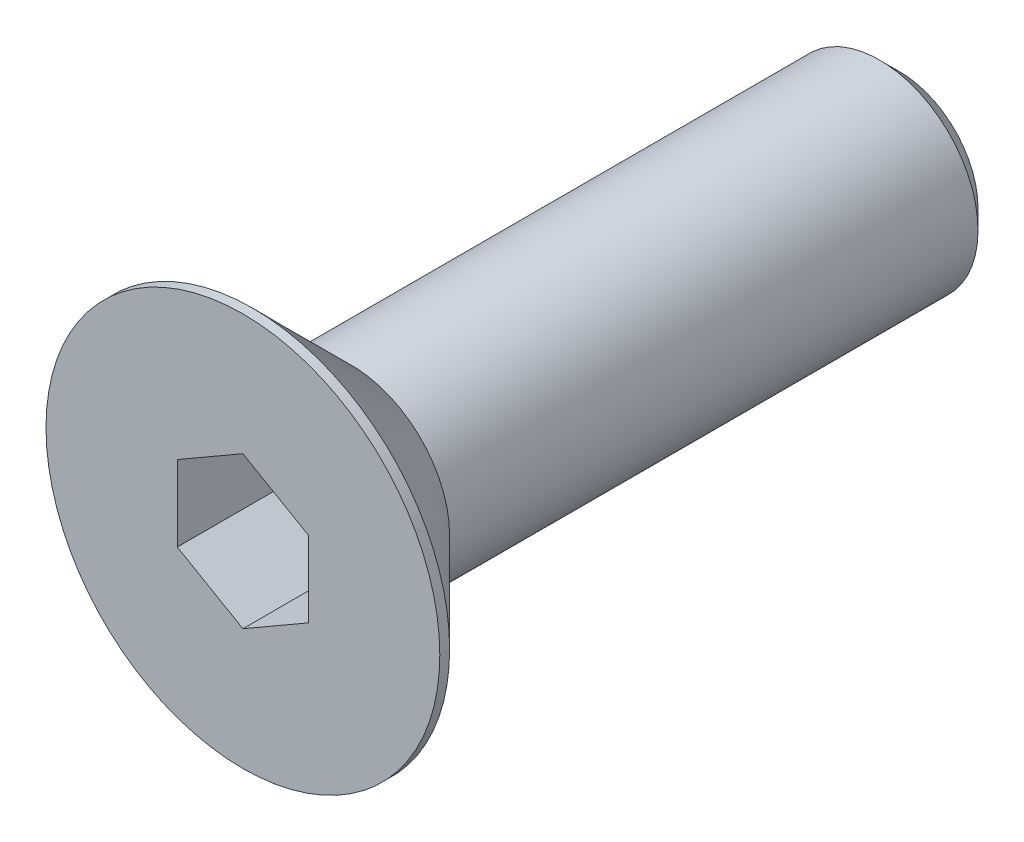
ISO-10303-21;
HEADER;
FILE_DESCRIPTION(('STEP AP214'),'2;1');
FILE_NAME('part.step','',(''),(''),'','','');
FILE_SCHEMA(('AUTOMOTIVE_DESIGN { 1 0 10303 214 1 1 1 1 }'));
ENDSEC;
DATA;
#1=APPLICATION_CONTEXT('core data for automotive mechanical design processes');
#2=APPLICATION_PROTOCOL_DEFINITION('international standard','automotive_design',2000,#1);
#3=PRODUCT_CONTEXT('',#1,'mechanical');
#4=PRODUCT('Part','Part','',(#3));
#5=PRODUCT_RELATED_PRODUCT_CATEGORY('part','',(#4));
#6=PRODUCT_DEFINITION_FORMATION('','',#4);
#7=PRODUCT_DEFINITION_CONTEXT('part definition',#1,'design');
#8=PRODUCT_DEFINITION('design','',#6,#7);
#9=PRODUCT_DEFINITION_SHAPE('','',#8);
#10=(LENGTH_UNIT() NAMED_UNIT(*) SI_UNIT(.MILLI.,.METRE.));
#11=(NAMED_UNIT(*) PLANE_ANGLE_UNIT() SI_UNIT($,.RADIAN.));
#12=(NAMED_UNIT(*) SI_UNIT($,.STERADIAN.) SOLID_ANGLE_UNIT());
#13=UNCERTAINTY_MEASURE_WITH_UNIT(LENGTH_MEASURE(1.E-05),#10,'distance_accuracy_value','');
#14=(GEOMETRIC_REPRESENTATION_CONTEXT(3) GLOBAL_UNCERTAINTY_ASSIGNED_CONTEXT((#13)) GLOBAL_UNIT_ASSIGNED_CONTEXT((#10,
#11,#12)) REPRESENTATION_CONTEXT('',''));
#15=CARTESIAN_POINT('',(0.,0.,0.));
#16=DIRECTION('',(0.,0.,1.));
#17=DIRECTION('',(1.,0.,0.));
#18=AXIS2_PLACEMENT_3D('',#15,#16,#17);
#19=CARTESIAN_POINT('',(0.,0.,-20.));
#20=DIRECTION('',(0.,0.,1.));
#21=DIRECTION('',(1.,0.,0.));
#22=AXIS2_PLACEMENT_3D('',#19,#20,#21);
#23=PLANE('',#22);
#24=CARTESIAN_POINT('',(0.,0.,-20.));
#25=DIRECTION('',(0.,0.,1.));
#26=DIRECTION('',(1.,0.,0.));
#27=AXIS2_PLACEMENT_3D('',#24,#25,#26);
#28=CIRCLE('',#27,2.4);
#29=CARTESIAN_POINT('',(2.4,0.,-20.));
#30=VERTEX_POINT('',#29);
#31=EDGE_CURVE('E11',#30,#30,#28,.F.);
#32=ORIENTED_EDGE('',*,*,#31,.T.);
#33=EDGE_LOOP('',(#32));
#34=FACE_BOUND('',#33,.T.);
#35=ADVANCED_FACE('F348',(#34),#23,.F.);
#36=CARTESIAN_POINT('',(0.,0.,0.));
#37=DIRECTION('',(0.,0.,1.));
#38=DIRECTION('',(1.,0.,0.));
#39=AXIS2_PLACEMENT_3D('',#36,#37,#38);
#40=CYLINDRICAL_SURFACE('',#39,3.);
#41=CARTESIAN_POINT('',(0.,0.,-19.4));
#42=DIRECTION('',(0.,0.,1.));
#43=DIRECTION('',(1.,0.,0.));
#44=AXIS2_PLACEMENT_3D('',#41,#42,#43);
#45=CIRCLE('',#44,3.);
#46=CARTESIAN_POINT('',(3.,0.,-19.4));
#47=VERTEX_POINT('',#46);
#48=EDGE_CURVE('E355',#47,#47,#45,.T.);
#49=ORIENTED_EDGE('',*,*,#48,.T.);
#50=EDGE_LOOP('',(#49));
#51=FACE_BOUND('',#50,.T.);
#52=CARTESIAN_POINT('',(0.,0.,-3.3));
#53=DIRECTION('',(0.,0.,1.));
#54=DIRECTION('',(1.,0.,0.));
#55=AXIS2_PLACEMENT_3D('',#52,#53,#54);
#56=CIRCLE('',#55,3.);
#57=CARTESIAN_POINT('',(3.,0.,-3.3));
#58=VERTEX_POINT('',#57);
#59=EDGE_CURVE('E462',#58,#58,#56,.T.);
#60=ORIENTED_EDGE('',*,*,#59,.F.);
#61=EDGE_LOOP('',(#60));
#62=FACE_BOUND('',#61,.T.);
#63=ADVANCED_FACE('F467',(#51,#62),#40,.T.);
#64=CARTESIAN_POINT('',(0.,0.,-3.3));
#65=DIRECTION('',(0.,0.,1.));
#66=DIRECTION('',(1.,0.,0.));
#67=AXIS2_PLACEMENT_3D('',#64,#65,#66);
#68=CONICAL_SURFACE('',#67,3.,0.785398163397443);
#69=CARTESIAN_POINT('',(0.,0.,-0.299999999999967));
#70=DIRECTION('',(0.,0.,1.));
#71=DIRECTION('',(1.,0.,0.));
#72=AXIS2_PLACEMENT_3D('',#69,#70,#71);
#73=CIRCLE('',#72,6.);
#74=CARTESIAN_POINT('',(6.,0.,-0.299999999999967));
#75=VERTEX_POINT('',#74);
#76=EDGE_CURVE('E459',#75,#75,#73,.T.);
#77=ORIENTED_EDGE('',*,*,#76,.F.);
#78=EDGE_LOOP('',(#77));
#79=FACE_BOUND('',#78,.T.);
#80=ORIENTED_EDGE('',*,*,#59,.T.);
#81=EDGE_LOOP('',(#80));
#82=FACE_BOUND('',#81,.T.);
#83=ADVANCED_FACE('F489',(#79,#82),#68,.T.);
#84=CARTESIAN_POINT('',(0.,0.,0.));
#85=DIRECTION('',(0.,0.,1.));
#86=DIRECTION('',(1.,0.,0.));
#87=AXIS2_PLACEMENT_3D('',#84,#85,#86);
#88=CYLINDRICAL_SURFACE('',#87,6.);
#89=CARTESIAN_POINT('',(0.,0.,0.));
#90=DIRECTION('',(0.,0.,1.));
#91=DIRECTION('',(1.,0.,0.));
#92=AXIS2_PLACEMENT_3D('',#89,#90,#91);
#93=CIRCLE('',#92,6.);
#94=CARTESIAN_POINT('',(6.,0.,0.));
#95=VERTEX_POINT('',#94);
#96=EDGE_CURVE('E450',#95,#95,#93,.T.);
#97=ORIENTED_EDGE('',*,*,#96,.F.);
#98=EDGE_LOOP('',(#97));
#99=FACE_BOUND('',#98,.T.);
#100=ORIENTED_EDGE('',*,*,#76,.T.);
#101=EDGE_LOOP('',(#100));
#102=FACE_BOUND('',#101,.T.);
#103=ADVANCED_FACE('F481',(#99,#102),#88,.T.);
#104=CARTESIAN_POINT('',(0.,6.,0.));
#105=DIRECTION('',(0.,0.,-1.));
#106=DIRECTION('',(-1.,0.,0.));
#107=AXIS2_PLACEMENT_3D('',#104,#105,#106);
#108=PLANE('',#107);
#109=DIRECTION('',(0.,1.,0.));
#110=VECTOR('',#109,1.);
#111=CARTESIAN_POINT('',(2.,-1.15470053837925,0.));
#112=LINE('',#111,#110);
#113=CARTESIAN_POINT('',(2.,-1.15470053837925,0.));
#114=VERTEX_POINT('',#113);
#115=CARTESIAN_POINT('',(2.,1.15470053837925,0.));
#116=VERTEX_POINT('',#115);
#117=EDGE_CURVE('E416',#114,#116,#112,.T.);
#118=ORIENTED_EDGE('',*,*,#117,.F.);
#119=DIRECTION('',(0.866025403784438,0.5,0.));
#120=VECTOR('',#119,1.);
#121=CARTESIAN_POINT('',(0.,-2.3094010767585,0.));
#122=LINE('',#121,#120);
#123=CARTESIAN_POINT('',(0.,-2.3094010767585,0.));
#124=VERTEX_POINT('',#123);
#125=EDGE_CURVE('E362',#124,#114,#122,.T.);
#126=ORIENTED_EDGE('',*,*,#125,.F.);
#127=DIRECTION('',(0.866025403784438,-0.5,0.));
#128=VECTOR('',#127,1.);
#129=CARTESIAN_POINT('',(-2.,-1.15470053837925,0.));
#130=LINE('',#129,#128);
#131=CARTESIAN_POINT('',(-2.,-1.15470053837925,0.));
#132=VERTEX_POINT('',#131);
#133=EDGE_CURVE('E432',#132,#124,#130,.T.);
#134=ORIENTED_EDGE('',*,*,#133,.F.);
#135=DIRECTION('',(0.,-1.,0.));
#136=VECTOR('',#135,1.);
#137=CARTESIAN_POINT('',(-2.,1.15470053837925,0.));
#138=LINE('',#137,#136);
#139=CARTESIAN_POINT('',(-2.,1.15470053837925,0.));
#140=VERTEX_POINT('',#139);
#141=EDGE_CURVE('E426',#140,#132,#138,.T.);
#142=ORIENTED_EDGE('',*,*,#141,.F.);
#143=DIRECTION('',(-0.866025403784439,-0.5,0.));
#144=VECTOR('',#143,1.);
#145=CARTESIAN_POINT('',(0.,2.3094010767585,0.));
#146=LINE('',#145,#144);
#147=CARTESIAN_POINT('',(0.,2.3094010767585,0.));
#148=VERTEX_POINT('',#147);
#149=EDGE_CURVE('E424',#148,#140,#146,.T.);
#150=ORIENTED_EDGE('',*,*,#149,.F.);
#151=DIRECTION('',(-0.866025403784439,0.5,0.));
#152=VECTOR('',#151,1.);
#153=CARTESIAN_POINT('',(2.,1.15470053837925,0.));
#154=LINE('',#153,#152);
#155=EDGE_CURVE('E405',#116,#148,#154,.T.);
#156=ORIENTED_EDGE('',*,*,#155,.F.);
#157=EDGE_LOOP('',(#118,#126,#134,#142,#150,#156));
#158=FACE_BOUND('',#157,.T.);
#159=ORIENTED_EDGE('',*,*,#96,.T.);
#160=EDGE_LOOP('',(#159));
#161=FACE_BOUND('',#160,.T.);
#162=ADVANCED_FACE('F420',(#158,#161),#108,.F.);
#163=CARTESIAN_POINT('',(0.,0.,-19.4));
#164=DIRECTION('',(0.,0.,1.));
#165=DIRECTION('',(1.,0.,0.));
#166=AXIS2_PLACEMENT_3D('',#163,#164,#165);
#167=CONICAL_SURFACE('',#166,3.,0.785398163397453);
#168=ORIENTED_EDGE('',*,*,#31,.F.);
#169=EDGE_LOOP('',(#168));
#170=FACE_BOUND('',#169,.T.);
#171=ORIENTED_EDGE('',*,*,#48,.F.);
#172=EDGE_LOOP('',(#171));
#173=FACE_BOUND('',#172,.T.);
#174=ADVANCED_FACE('F470',(#170,#173),#167,.T.);
#175=CARTESIAN_POINT('',(0.,-2.3094010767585,-3.));
#176=DIRECTION('',(0.5,-0.866025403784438,0.));
#177=DIRECTION('',(0.866025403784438,0.5,0.));
#178=AXIS2_PLACEMENT_3D('',#175,#176,#177);
#179=PLANE('',#178);
#180=ORIENTED_EDGE('',*,*,#125,.T.);
#181=DIRECTION('',(0.,0.,1.));
#182=VECTOR('',#181,1.);
#183=CARTESIAN_POINT('',(2.,-1.15470053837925,-3.));
#184=LINE('',#183,#182);
#185=CARTESIAN_POINT('',(2.,-1.15470053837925,-3.));
#186=VERTEX_POINT('',#185);
#187=EDGE_CURVE('E413',#186,#114,#184,.T.);
#188=ORIENTED_EDGE('',*,*,#187,.F.);
#189=DIRECTION('',(0.866025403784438,0.5,0.));
#190=VECTOR('',#189,1.);
#191=CARTESIAN_POINT('',(0.,-2.3094010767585,-3.));
#192=LINE('',#191,#190);
#193=CARTESIAN_POINT('',(0.,-2.3094010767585,-3.));
#194=VERTEX_POINT('',#193);
#195=EDGE_CURVE('E434',#194,#186,#192,.T.);
#196=ORIENTED_EDGE('',*,*,#195,.F.);
#197=DIRECTION('',(0.,0.,1.));
#198=VECTOR('',#197,1.);
#199=CARTESIAN_POINT('',(0.,-2.3094010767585,-3.));
#200=LINE('',#199,#198);
#201=EDGE_CURVE('E369',#194,#124,#200,.T.);
#202=ORIENTED_EDGE('',*,*,#201,.T.);
#203=EDGE_LOOP('',(#180,#188,#196,#202));
#204=FACE_BOUND('',#203,.T.);
#205=ADVANCED_FACE('F472',(#204),#179,.F.);
#206=CARTESIAN_POINT('',(-2.,-1.15470053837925,-3.));
#207=DIRECTION('',(-0.5,-0.866025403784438,0.));
#208=DIRECTION('',(0.866025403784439,-0.5,0.));
#209=AXIS2_PLACEMENT_3D('',#206,#207,#208);
#210=PLANE('',#209);
#211=ORIENTED_EDGE('',*,*,#133,.T.);
#212=ORIENTED_EDGE('',*,*,#201,.F.);
#213=DIRECTION('',(0.866025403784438,-0.5,0.));
#214=VECTOR('',#213,1.);
#215=CARTESIAN_POINT('',(-2.,-1.15470053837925,-3.));
#216=LINE('',#215,#214);
#217=CARTESIAN_POINT('',(-2.,-1.15470053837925,-3.));
#218=VERTEX_POINT('',#217);
#219=EDGE_CURVE('E446',#218,#194,#216,.T.);
#220=ORIENTED_EDGE('',*,*,#219,.F.);
#221=DIRECTION('',(0.,0.,1.));
#222=VECTOR('',#221,1.);
#223=CARTESIAN_POINT('',(-2.,-1.15470053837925,-3.));
#224=LINE('',#223,#222);
#225=EDGE_CURVE('E451',#218,#132,#224,.T.);
#226=ORIENTED_EDGE('',*,*,#225,.T.);
#227=EDGE_LOOP('',(#211,#212,#220,#226));
#228=FACE_BOUND('',#227,.T.);
#229=ADVANCED_FACE('F479',(#228),#210,.F.);
#230=CARTESIAN_POINT('',(-2.,1.15470053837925,-3.));
#231=DIRECTION('',(-1.,0.,0.));
#232=DIRECTION('',(0.,0.,1.));
#233=AXIS2_PLACEMENT_3D('',#230,#231,#232);
#234=PLANE('',#233);
#235=ORIENTED_EDGE('',*,*,#141,.T.);
#236=ORIENTED_EDGE('',*,*,#225,.F.);
#237=DIRECTION('',(0.,-1.,0.));
#238=VECTOR('',#237,1.);
#239=CARTESIAN_POINT('',(-2.,1.15470053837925,-3.));
#240=LINE('',#239,#238);
#241=CARTESIAN_POINT('',(-2.,1.15470053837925,-3.));
#242=VERTEX_POINT('',#241);
#243=EDGE_CURVE('E443',#242,#218,#240,.T.);
#244=ORIENTED_EDGE('',*,*,#243,.F.);
#245=DIRECTION('',(0.,0.,1.));
#246=VECTOR('',#245,1.);
#247=CARTESIAN_POINT('',(-2.,1.15470053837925,-3.));
#248=LINE('',#247,#246);
#249=EDGE_CURVE('E453',#242,#140,#248,.T.);
#250=ORIENTED_EDGE('',*,*,#249,.T.);
#251=EDGE_LOOP('',(#235,#236,#244,#250));
#252=FACE_BOUND('',#251,.T.);
#253=ADVANCED_FACE('F524',(#252),#234,.F.);
#254=CARTESIAN_POINT('',(0.,2.3094010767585,-3.));
#255=DIRECTION('',(-0.5,0.866025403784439,0.));
#256=DIRECTION('',(-0.866025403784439,-0.5,0.));
#257=AXIS2_PLACEMENT_3D('',#254,#255,#256);
#258=PLANE('',#257);
#259=ORIENTED_EDGE('',*,*,#149,.T.);
#260=ORIENTED_EDGE('',*,*,#249,.F.);
#261=DIRECTION('',(-0.866025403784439,-0.5,0.));
#262=VECTOR('',#261,1.);
#263=CARTESIAN_POINT('',(0.,2.3094010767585,-3.));
#264=LINE('',#263,#262);
#265=CARTESIAN_POINT('',(0.,2.3094010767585,-3.));
#266=VERTEX_POINT('',#265);
#267=EDGE_CURVE('E440',#266,#242,#264,.T.);
#268=ORIENTED_EDGE('',*,*,#267,.F.);
#269=DIRECTION('',(0.,0.,1.));
#270=VECTOR('',#269,1.);
#271=CARTESIAN_POINT('',(0.,2.3094010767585,-3.));
#272=LINE('',#271,#270);
#273=EDGE_CURVE('E412',#266,#148,#272,.T.);
#274=ORIENTED_EDGE('',*,*,#273,.T.);
#275=EDGE_LOOP('',(#259,#260,#268,#274));
#276=FACE_BOUND('',#275,.T.);
#277=ADVANCED_FACE('F531',(#276),#258,.F.);
#278=CARTESIAN_POINT('',(2.,1.15470053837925,-3.));
#279=DIRECTION('',(0.5,0.866025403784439,0.));
#280=DIRECTION('',(-0.866025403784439,0.5,0.));
#281=AXIS2_PLACEMENT_3D('',#278,#279,#280);
#282=PLANE('',#281);
#283=ORIENTED_EDGE('',*,*,#155,.T.);
#284=ORIENTED_EDGE('',*,*,#273,.F.);
#285=DIRECTION('',(-0.866025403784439,0.5,0.));
#286=VECTOR('',#285,1.);
#287=CARTESIAN_POINT('',(2.,1.15470053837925,-3.));
#288=LINE('',#287,#286);
#289=CARTESIAN_POINT('',(2.,1.15470053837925,-3.));
#290=VERTEX_POINT('',#289);
#291=EDGE_CURVE('E408',#290,#266,#288,.T.);
#292=ORIENTED_EDGE('',*,*,#291,.F.);
#293=DIRECTION('',(0.,0.,1.));
#294=VECTOR('',#293,1.);
#295=CARTESIAN_POINT('',(2.,1.15470053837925,-3.));
#296=LINE('',#295,#294);
#297=EDGE_CURVE('E401',#290,#116,#296,.T.);
#298=ORIENTED_EDGE('',*,*,#297,.T.);
#299=EDGE_LOOP('',(#283,#284,#292,#298));
#300=FACE_BOUND('',#299,.T.);
#301=ADVANCED_FACE('F403',(#300),#282,.F.);
#302=CARTESIAN_POINT('',(2.,-1.15470053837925,-3.));
#303=DIRECTION('',(1.,0.,0.));
#304=DIRECTION('',(0.,1.,0.));
#305=AXIS2_PLACEMENT_3D('',#302,#303,#304);
#306=PLANE('',#305);
#307=ORIENTED_EDGE('',*,*,#117,.T.);
#308=ORIENTED_EDGE('',*,*,#297,.F.);
#309=DIRECTION('',(0.,1.,0.));
#310=VECTOR('',#309,1.);
#311=CARTESIAN_POINT('',(2.,-1.15470053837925,-3.));
#312=LINE('',#311,#310);
#313=EDGE_CURVE('E437',#186,#290,#312,.T.);
#314=ORIENTED_EDGE('',*,*,#313,.F.);
#315=ORIENTED_EDGE('',*,*,#187,.T.);
#316=EDGE_LOOP('',(#307,#308,#314,#315));
#317=FACE_BOUND('',#316,.T.);
#318=ADVANCED_FACE('F417',(#317),#306,.F.);
#319=CARTESIAN_POINT('',(0.,-2.3094010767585,-3.));
#320=DIRECTION('',(0.,0.,-1.));
#321=DIRECTION('',(-1.,0.,0.));
#322=AXIS2_PLACEMENT_3D('',#319,#320,#321);
#323=PLANE('',#322);
#324=ORIENTED_EDGE('',*,*,#195,.T.);
#325=ORIENTED_EDGE('',*,*,#313,.T.);
#326=ORIENTED_EDGE('',*,*,#291,.T.);
#327=ORIENTED_EDGE('',*,*,#267,.T.);
#328=ORIENTED_EDGE('',*,*,#243,.T.);
#329=ORIENTED_EDGE('',*,*,#219,.T.);
#330=EDGE_LOOP('',(#324,#325,#326,#327,#328,#329));
#331=FACE_BOUND('',#330,.T.);
#332=ADVANCED_FACE('F552',(#331),#323,.F.);
#333=CLOSED_SHELL('',(#35,#63,#83,#103,#162,#174,#205,#229,#253,#277,#301,#318,#332));
#334=MANIFOLD_SOLID_BREP('B2',#333);
#335=ADVANCED_BREP_SHAPE_REPRESENTATION('',(#18,#334),#14);
#336=SHAPE_DEFINITION_REPRESENTATION(#9,#335);
ENDSEC;
END-ISO-10303-21;
